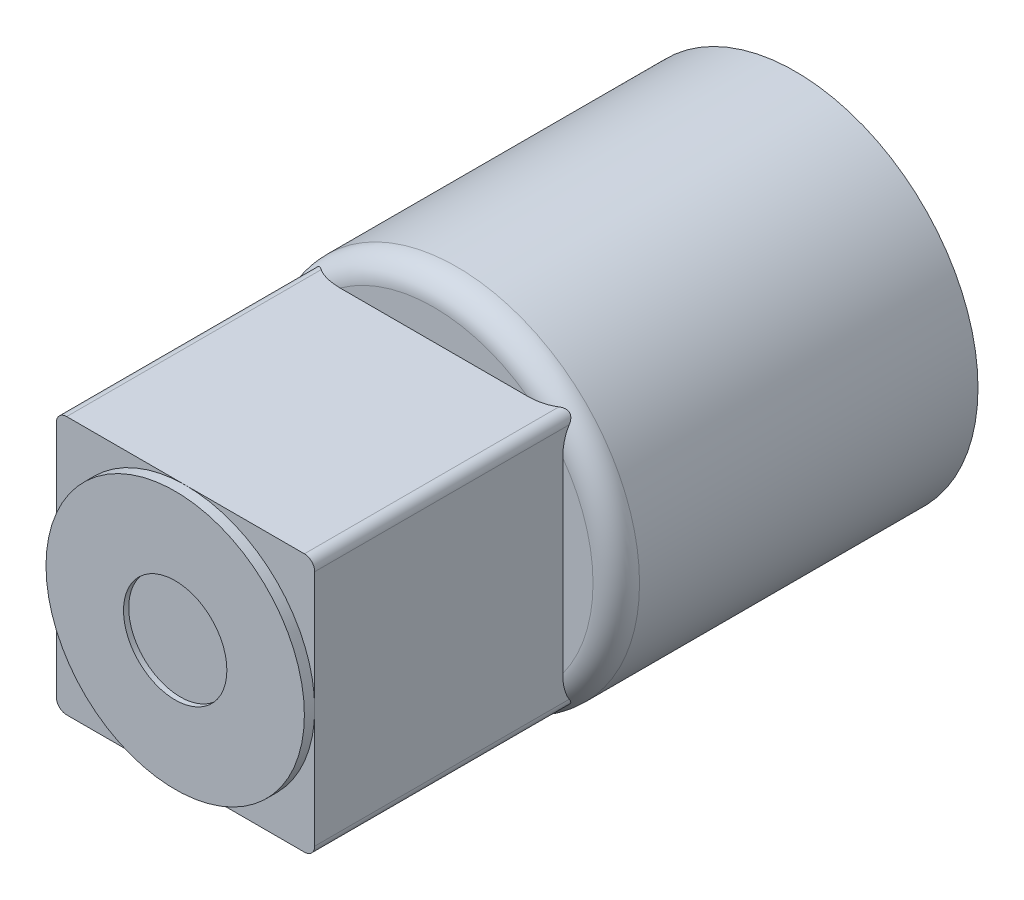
ISO-10303-21;
HEADER;
FILE_DESCRIPTION(('STEP AP214'),'2;1');
FILE_NAME('part.step','',(''),(''),'','','');
FILE_SCHEMA(('AUTOMOTIVE_DESIGN { 1 0 10303 214 1 1 1 1 }'));
ENDSEC;
DATA;
#1=APPLICATION_CONTEXT('core data for automotive mechanical design processes');
#2=APPLICATION_PROTOCOL_DEFINITION('international standard','automotive_design',2000,#1);
#3=PRODUCT_CONTEXT('',#1,'mechanical');
#4=PRODUCT('Part','Part','',(#3));
#5=PRODUCT_RELATED_PRODUCT_CATEGORY('part','',(#4));
#6=PRODUCT_DEFINITION_FORMATION('','',#4);
#7=PRODUCT_DEFINITION_CONTEXT('part definition',#1,'design');
#8=PRODUCT_DEFINITION('design','',#6,#7);
#9=PRODUCT_DEFINITION_SHAPE('','',#8);
#10=(LENGTH_UNIT() NAMED_UNIT(*) SI_UNIT(.MILLI.,.METRE.));
#11=(NAMED_UNIT(*) PLANE_ANGLE_UNIT() SI_UNIT($,.RADIAN.));
#12=(NAMED_UNIT(*) SI_UNIT($,.STERADIAN.) SOLID_ANGLE_UNIT());
#13=UNCERTAINTY_MEASURE_WITH_UNIT(LENGTH_MEASURE(1.E-05),#10,'distance_accuracy_value','');
#14=(GEOMETRIC_REPRESENTATION_CONTEXT(3) GLOBAL_UNCERTAINTY_ASSIGNED_CONTEXT((#13)) GLOBAL_UNIT_ASSIGNED_CONTEXT((#10,
#11,#12)) REPRESENTATION_CONTEXT('',''));
#15=CARTESIAN_POINT('',(0.,0.,0.));
#16=DIRECTION('',(0.,0.,1.));
#17=DIRECTION('',(1.,0.,0.));
#18=AXIS2_PLACEMENT_3D('',#15,#16,#17);
#19=CARTESIAN_POINT('',(0.,0.,12.7));
#20=DIRECTION('',(0.,0.,1.));
#21=DIRECTION('',(1.,0.,0.));
#22=AXIS2_PLACEMENT_3D('',#19,#20,#21);
#23=PLANE('',#22);
#24=CARTESIAN_POINT('',(0.,0.,12.7));
#25=DIRECTION('',(0.,0.,1.));
#26=DIRECTION('',(1.,0.,0.));
#27=AXIS2_PLACEMENT_3D('',#24,#25,#26);
#28=CIRCLE('',#27,2.54);
#29=CARTESIAN_POINT('',(2.54,0.,12.7));
#30=VERTEX_POINT('',#29);
#31=EDGE_CURVE('E535',#30,#30,#28,.T.);
#32=ORIENTED_EDGE('',*,*,#31,.F.);
#33=EDGE_LOOP('',(#32));
#34=FACE_BOUND('',#33,.T.);
#35=CARTESIAN_POINT('',(0.,0.,12.7));
#36=DIRECTION('',(0.,0.,1.));
#37=DIRECTION('',(1.,0.,0.));
#38=AXIS2_PLACEMENT_3D('',#35,#36,#37);
#39=CIRCLE('',#38,6.35);
#40=CARTESIAN_POINT('',(6.35,0.,12.7));
#41=VERTEX_POINT('',#40);
#42=EDGE_CURVE('E405',#41,#41,#39,.T.);
#43=ORIENTED_EDGE('',*,*,#42,.T.);
#44=EDGE_LOOP('',(#43));
#45=FACE_BOUND('',#44,.T.);
#46=ADVANCED_FACE('F84',(#34,#45),#23,.T.);
#47=CARTESIAN_POINT('',(0.,-6.35,12.7));
#48=DIRECTION('',(0.,1.,0.));
#49=DIRECTION('',(0.,0.,1.));
#50=AXIS2_PLACEMENT_3D('',#47,#48,#49);
#51=PLANE('',#50);
#52=DIRECTION('',(1.,0.,0.));
#53=VECTOR('',#52,1.);
#54=CARTESIAN_POINT('',(0.,-6.35,12.192));
#55=LINE('',#54,#53);
#56=CARTESIAN_POINT('',(0.,-6.35,12.192));
#57=VERTEX_POINT('',#56);
#58=CARTESIAN_POINT('',(5.842,-6.35,12.192));
#59=VERTEX_POINT('',#58);
#60=EDGE_CURVE('E206',#57,#59,#55,.T.);
#61=ORIENTED_EDGE('',*,*,#60,.F.);
#62=DIRECTION('',(1.,0.,0.));
#63=VECTOR('',#62,1.);
#64=CARTESIAN_POINT('',(0.,-6.35,12.192));
#65=LINE('',#64,#63);
#66=CARTESIAN_POINT('',(-5.842,-6.35,12.192));
#67=VERTEX_POINT('',#66);
#68=EDGE_CURVE('E220',#67,#57,#65,.T.);
#69=ORIENTED_EDGE('',*,*,#68,.F.);
#70=DIRECTION('',(0.,0.,-1.));
#71=VECTOR('',#70,1.);
#72=CARTESIAN_POINT('',(-5.842,-6.35,-1.143));
#73=LINE('',#72,#71);
#74=CARTESIAN_POINT('',(-5.842,-6.35,-0.318172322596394));
#75=VERTEX_POINT('',#74);
#76=EDGE_CURVE('E355',#67,#75,#73,.T.);
#77=ORIENTED_EDGE('',*,*,#76,.T.);
#78=CARTESIAN_POINT('',(-6.35,-6.35,-1.143));
#79=CARTESIAN_POINT('',(-6.35000403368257,-6.35,-1.11765135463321));
#80=CARTESIAN_POINT('',(-6.34880643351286,-6.35,-1.09231791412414));
#81=CARTESIAN_POINT('',(-6.34405763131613,-6.35,-1.04188941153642));
#82=CARTESIAN_POINT('',(-6.34050802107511,-6.35,-1.01679419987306));
#83=CARTESIAN_POINT('',(-6.32648475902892,-6.35,-0.942558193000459));
#84=CARTESIAN_POINT('',(-6.31263470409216,-6.35,-0.894020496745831));
#85=CARTESIAN_POINT('',(-6.27691926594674,-6.35,-0.800195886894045));
#86=CARTESIAN_POINT('',(-6.25507265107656,-6.35,-0.754901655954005));
#87=CARTESIAN_POINT('',(-6.20460739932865,-6.35,-0.668186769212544));
#88=CARTESIAN_POINT('',(-6.17597494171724,-6.35,-0.62677426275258));
#89=CARTESIAN_POINT('',(-6.10145182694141,-6.35,-0.533574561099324));
#90=CARTESIAN_POINT('',(-6.0531201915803,-6.35,-0.483742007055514));
#91=CARTESIAN_POINT('',(-5.94911311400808,-6.35,-0.392528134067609));
#92=CARTESIAN_POINT('',(-5.89342757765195,-6.35,-0.351158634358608));
#93=CARTESIAN_POINT('',(-5.75177486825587,-6.35,-0.260229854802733));
#94=CARTESIAN_POINT('',(-5.66312778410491,-6.35,-0.214867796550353));
#95=CARTESIAN_POINT('',(-5.47965992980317,-6.35,-0.138405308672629));
#96=CARTESIAN_POINT('',(-5.38481413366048,-6.35,-0.10736736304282));
#97=CARTESIAN_POINT('',(-5.23143400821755,-6.35,-0.0678926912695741));
#98=CARTESIAN_POINT('',(-5.17388950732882,-6.35,-0.0554024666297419));
#99=CARTESIAN_POINT('',(-5.05804890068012,-6.35,-0.0344060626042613));
#100=CARTESIAN_POINT('',(-4.99975247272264,-6.35,-0.0259016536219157));
#101=CARTESIAN_POINT('',(-4.8835088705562,-6.35,-0.0126387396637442));
#102=CARTESIAN_POINT('',(-4.82556688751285,-6.35,-0.00783334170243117));
#103=CARTESIAN_POINT('',(-4.70957225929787,-6.35,-0.00151923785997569));
#104=CARTESIAN_POINT('',(-4.6515198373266,-6.35,-6.49177456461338E-06));
#105=CARTESIAN_POINT('',(-4.59348272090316,-6.35,0.));
#106=B_SPLINE_CURVE_WITH_KNOTS('',3,(#78,#79,#80,#81,#82,#83,#84,#85,#86,#87,#88,#89,#90,#91,
#92,#93,#94,#95,#96,#97,#98,#99,#100,#101,#102,#103,#104,#105),.UNSPECIFIED.,.F.,.F.,(4,2,2,2,2,
2,2,2,2,2,2,2,2,4),(0.,0.0759887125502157,0.151926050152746,0.302481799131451,0.452686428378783,
0.603199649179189,0.810311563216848,1.01771077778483,1.31481675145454,1.61320677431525,
1.7897339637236,1.96633948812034,2.14066750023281,2.31478148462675),.UNSPECIFIED.);
#107=CARTESIAN_POINT('',(-4.59348272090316,-6.35,0.));
#108=VERTEX_POINT('',#107);
#109=EDGE_CURVE('E381',#75,#108,#106,.T.);
#110=ORIENTED_EDGE('',*,*,#109,.T.);
#111=DIRECTION('',(1.,0.,0.));
#112=VECTOR('',#111,1.);
#113=CARTESIAN_POINT('',(0.,-6.35,0.));
#114=LINE('',#113,#112);
#115=CARTESIAN_POINT('',(4.59348272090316,-6.35,0.));
#116=VERTEX_POINT('',#115);
#117=EDGE_CURVE('E237',#108,#116,#114,.T.);
#118=ORIENTED_EDGE('',*,*,#117,.T.);
#119=CARTESIAN_POINT('',(4.59348272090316,-6.35,0.));
#120=CARTESIAN_POINT('',(4.67397091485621,-6.35,-2.43250025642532E-05));
#121=CARTESIAN_POINT('',(4.75452886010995,-6.35,-0.0029243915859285));
#122=CARTESIAN_POINT('',(4.91553563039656,-6.35,-0.0152832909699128));
#123=CARTESIAN_POINT('',(4.9959818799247,-6.35,-0.0247749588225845));
#124=CARTESIAN_POINT('',(5.15694011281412,-6.35,-0.0513453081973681));
#125=CARTESIAN_POINT('',(5.23743358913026,-6.35,-0.0685399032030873));
#126=CARTESIAN_POINT('',(5.39595174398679,-6.35,-0.11151736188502));
#127=CARTESIAN_POINT('',(5.47398169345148,-6.35,-0.137280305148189));
#128=CARTESIAN_POINT('',(5.62003039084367,-6.35,-0.196062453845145));
#129=CARTESIAN_POINT('',(5.68834863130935,-6.35,-0.228327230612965));
#130=CARTESIAN_POINT('',(5.81971354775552,-6.35,-0.301892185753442));
#131=CARTESIAN_POINT('',(5.88277939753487,-6.35,-0.343157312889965));
#132=CARTESIAN_POINT('',(5.99208115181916,-6.35,-0.428308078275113));
#133=CARTESIAN_POINT('',(6.03940787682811,-6.35,-0.470781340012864));
#134=CARTESIAN_POINT('',(6.12658855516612,-6.35,-0.562898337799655));
#135=CARTESIAN_POINT('',(6.16644789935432,-6.35,-0.612536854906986));
#136=CARTESIAN_POINT('',(6.22890336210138,-6.35,-0.707428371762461));
#137=CARTESIAN_POINT('',(6.25336557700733,-6.35,-0.751450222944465));
#138=CARTESIAN_POINT('',(6.29465578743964,-6.35,-0.842905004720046));
#139=CARTESIAN_POINT('',(6.3114991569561,-6.35,-0.890330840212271));
#140=CARTESIAN_POINT('',(6.33254351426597,-6.35,-0.972133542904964));
#141=CARTESIAN_POINT('',(6.33905399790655,-6.35,-1.00592791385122));
#142=CARTESIAN_POINT('',(6.34779790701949,-6.35,-1.07413758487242));
#143=CARTESIAN_POINT('',(6.35002201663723,-6.35,-1.10855407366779));
#144=CARTESIAN_POINT('',(6.35,-6.35,-1.143));
#145=B_SPLINE_CURVE_WITH_KNOTS('',3,(#119,#120,#121,#122,#123,#124,#125,#126,#127,#128,#129,
#130,#131,#132,#133,#134,#135,#136,#137,#138,#139,#140,#141,#142,#143,#144),.UNSPECIFIED.,.F.,
.F.,(4,2,2,2,2,2,2,2,2,2,2,2,4),(0.,0.241519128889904,0.484250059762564,0.730763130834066,
0.976707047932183,1.20278029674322,1.42798835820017,1.61807342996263,1.80802074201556,
1.95850839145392,2.10869100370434,2.21168152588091,2.31489563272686),.UNSPECIFIED.);
#146=CARTESIAN_POINT('',(5.84200000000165,-6.35,-0.318172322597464));
#147=VERTEX_POINT('',#146);
#148=EDGE_CURVE('E315',#116,#147,#145,.T.);
#149=ORIENTED_EDGE('',*,*,#148,.T.);
#150=DIRECTION('',(0.,0.,-1.));
#151=VECTOR('',#150,1.);
#152=CARTESIAN_POINT('',(5.842,-6.35,12.7));
#153=LINE('',#152,#151);
#154=EDGE_CURVE('E223',#147,#59,#153,.F.);
#155=ORIENTED_EDGE('',*,*,#154,.T.);
#156=EDGE_LOOP('',(#61,#69,#77,#110,#118,#149,#155));
#157=FACE_BOUND('',#156,.T.);
#158=ADVANCED_FACE('F218',(#157),#51,.F.);
#159=CARTESIAN_POINT('',(6.35,0.,12.7));
#160=DIRECTION('',(-1.,0.,0.));
#161=DIRECTION('',(0.,0.,1.));
#162=AXIS2_PLACEMENT_3D('',#159,#160,#161);
#163=PLANE('',#162);
#164=DIRECTION('',(0.,1.,0.));
#165=VECTOR('',#164,1.);
#166=CARTESIAN_POINT('',(6.35,0.,12.192));
#167=LINE('',#166,#165);
#168=CARTESIAN_POINT('',(6.35,-5.842,12.192));
#169=VERTEX_POINT('',#168);
#170=CARTESIAN_POINT('',(6.35,0.,12.192));
#171=VERTEX_POINT('',#170);
#172=EDGE_CURVE('E209',#169,#171,#167,.T.);
#173=ORIENTED_EDGE('',*,*,#172,.F.);
#174=DIRECTION('',(0.,0.,-1.));
#175=VECTOR('',#174,1.);
#176=CARTESIAN_POINT('',(6.35,-5.842,12.7));
#177=LINE('',#176,#175);
#178=CARTESIAN_POINT('',(6.35,-5.842,-0.318172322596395));
#179=VERTEX_POINT('',#178);
#180=EDGE_CURVE('E360',#169,#179,#177,.T.);
#181=ORIENTED_EDGE('',*,*,#180,.T.);
#182=CARTESIAN_POINT('',(6.35,-6.35,-1.143));
#183=CARTESIAN_POINT('',(6.35,-6.35000403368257,-1.11765135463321));
#184=CARTESIAN_POINT('',(6.35,-6.34880643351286,-1.09231791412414));
#185=CARTESIAN_POINT('',(6.35,-6.34405763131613,-1.04188941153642));
#186=CARTESIAN_POINT('',(6.35,-6.34050802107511,-1.01679419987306));
#187=CARTESIAN_POINT('',(6.35,-6.32648475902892,-0.942558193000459));
#188=CARTESIAN_POINT('',(6.35,-6.31263470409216,-0.894020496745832));
#189=CARTESIAN_POINT('',(6.35,-6.27691926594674,-0.800195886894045));
#190=CARTESIAN_POINT('',(6.35,-6.25507265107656,-0.754901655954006));
#191=CARTESIAN_POINT('',(6.35,-6.20460739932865,-0.668186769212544));
#192=CARTESIAN_POINT('',(6.35,-6.17597494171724,-0.626774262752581));
#193=CARTESIAN_POINT('',(6.35,-6.10145182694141,-0.533574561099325));
#194=CARTESIAN_POINT('',(6.35,-6.0531201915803,-0.483742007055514));
#195=CARTESIAN_POINT('',(6.35,-5.94911311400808,-0.392528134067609));
#196=CARTESIAN_POINT('',(6.35,-5.89342757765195,-0.351158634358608));
#197=CARTESIAN_POINT('',(6.35,-5.75177486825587,-0.260229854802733));
#198=CARTESIAN_POINT('',(6.35,-5.66312778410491,-0.214867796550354));
#199=CARTESIAN_POINT('',(6.35,-5.47965992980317,-0.13840530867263));
#200=CARTESIAN_POINT('',(6.35,-5.38481413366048,-0.10736736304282));
#201=CARTESIAN_POINT('',(6.35,-5.23143400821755,-0.0678926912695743));
#202=CARTESIAN_POINT('',(6.35,-5.17388950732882,-0.0554024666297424));
#203=CARTESIAN_POINT('',(6.35,-5.05804890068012,-0.0344060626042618));
#204=CARTESIAN_POINT('',(6.35,-4.99975247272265,-0.0259016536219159));
#205=CARTESIAN_POINT('',(6.35,-4.8835088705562,-0.0126387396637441));
#206=CARTESIAN_POINT('',(6.35,-4.82556688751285,-0.00783334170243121));
#207=CARTESIAN_POINT('',(6.35,-4.70957225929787,-0.00151923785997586));
#208=CARTESIAN_POINT('',(6.35,-4.6515198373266,-6.49177456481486E-06));
#209=CARTESIAN_POINT('',(6.35,-4.59348272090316,0.));
#210=B_SPLINE_CURVE_WITH_KNOTS('',3,(#182,#183,#184,#185,#186,#187,#188,#189,#190,#191,#192,
#193,#194,#195,#196,#197,#198,#199,#200,#201,#202,#203,#204,#205,#206,#207,#208,#209),
.UNSPECIFIED.,.F.,.F.,(4,2,2,2,2,2,2,2,2,2,2,2,2,4),(0.,0.0759887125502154,0.151926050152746,
0.302481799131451,0.452686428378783,0.603199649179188,0.810311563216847,1.01771077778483,
1.31481675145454,1.61320677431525,1.7897339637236,1.96633948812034,2.14066750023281,
2.31478148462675),.UNSPECIFIED.);
#211=CARTESIAN_POINT('',(6.35,-4.59348272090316,0.));
#212=VERTEX_POINT('',#211);
#213=EDGE_CURVE('E310',#179,#212,#210,.T.);
#214=ORIENTED_EDGE('',*,*,#213,.T.);
#215=DIRECTION('',(0.,1.,0.));
#216=VECTOR('',#215,1.);
#217=CARTESIAN_POINT('',(6.35,0.,0.));
#218=LINE('',#217,#216);
#219=CARTESIAN_POINT('',(6.35,4.59348272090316,0.));
#220=VERTEX_POINT('',#219);
#221=EDGE_CURVE('E244',#212,#220,#218,.T.);
#222=ORIENTED_EDGE('',*,*,#221,.T.);
#223=CARTESIAN_POINT('',(6.35,4.59348272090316,0.));
#224=CARTESIAN_POINT('',(6.35,4.67397091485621,-2.43250025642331E-05));
#225=CARTESIAN_POINT('',(6.35,4.75452886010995,-0.00292439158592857));
#226=CARTESIAN_POINT('',(6.35,4.91553563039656,-0.015283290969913));
#227=CARTESIAN_POINT('',(6.35,4.9959818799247,-0.0247749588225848));
#228=CARTESIAN_POINT('',(6.35,5.15694011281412,-0.0513453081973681));
#229=CARTESIAN_POINT('',(6.35,5.23743358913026,-0.0685399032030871));
#230=CARTESIAN_POINT('',(6.35,5.39595174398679,-0.111517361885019));
#231=CARTESIAN_POINT('',(6.35,5.47398169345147,-0.137280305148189));
#232=CARTESIAN_POINT('',(6.35,5.62003039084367,-0.196062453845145));
#233=CARTESIAN_POINT('',(6.35,5.68834863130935,-0.228327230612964));
#234=CARTESIAN_POINT('',(6.35,5.81971354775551,-0.301892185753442));
#235=CARTESIAN_POINT('',(6.35,5.88277939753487,-0.343157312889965));
#236=CARTESIAN_POINT('',(6.35,5.99208115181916,-0.428308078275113));
#237=CARTESIAN_POINT('',(6.35,6.03940787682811,-0.470781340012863));
#238=CARTESIAN_POINT('',(6.35,6.12658855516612,-0.562898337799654));
#239=CARTESIAN_POINT('',(6.35,6.16644789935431,-0.612536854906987));
#240=CARTESIAN_POINT('',(6.35,6.22890336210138,-0.707428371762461));
#241=CARTESIAN_POINT('',(6.35,6.25336557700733,-0.751450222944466));
#242=CARTESIAN_POINT('',(6.35,6.29465578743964,-0.842905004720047));
#243=CARTESIAN_POINT('',(6.35,6.3114991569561,-0.890330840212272));
#244=CARTESIAN_POINT('',(6.35,6.33254351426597,-0.972133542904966));
#245=CARTESIAN_POINT('',(6.35,6.33905399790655,-1.00592791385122));
#246=CARTESIAN_POINT('',(6.35,6.34779790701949,-1.07413758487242));
#247=CARTESIAN_POINT('',(6.35,6.35002201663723,-1.10855407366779));
#248=CARTESIAN_POINT('',(6.35,6.35,-1.143));
#249=B_SPLINE_CURVE_WITH_KNOTS('',3,(#223,#224,#225,#226,#227,#228,#229,#230,#231,#232,#233,
#234,#235,#236,#237,#238,#239,#240,#241,#242,#243,#244,#245,#246,#247,#248),.UNSPECIFIED.,.F.,
.F.,(4,2,2,2,2,2,2,2,2,2,2,2,4),(0.,0.241519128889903,0.484250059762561,0.730763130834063,
0.976707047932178,1.20278029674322,1.42798835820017,1.61807342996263,1.80802074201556,
1.95850839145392,2.10869100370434,2.21168152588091,2.31489563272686),.UNSPECIFIED.);
#250=CARTESIAN_POINT('',(6.35,5.84200000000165,-0.318172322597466));
#251=VERTEX_POINT('',#250);
#252=EDGE_CURVE('E304',#220,#251,#249,.T.);
#253=ORIENTED_EDGE('',*,*,#252,.T.);
#254=DIRECTION('',(0.,0.,-1.));
#255=VECTOR('',#254,1.);
#256=CARTESIAN_POINT('',(6.35,5.842,12.7));
#257=LINE('',#256,#255);
#258=CARTESIAN_POINT('',(6.35,5.842,12.192));
#259=VERTEX_POINT('',#258);
#260=EDGE_CURVE('E357',#251,#259,#257,.F.);
#261=ORIENTED_EDGE('',*,*,#260,.T.);
#262=DIRECTION('',(0.,1.,0.));
#263=VECTOR('',#262,1.);
#264=CARTESIAN_POINT('',(6.35,0.,12.192));
#265=LINE('',#264,#263);
#266=EDGE_CURVE('E104',#171,#259,#265,.T.);
#267=ORIENTED_EDGE('',*,*,#266,.F.);
#268=EDGE_LOOP('',(#173,#181,#214,#222,#253,#261,#267));
#269=FACE_BOUND('',#268,.T.);
#270=ADVANCED_FACE('F296',(#269),#163,.F.);
#271=CARTESIAN_POINT('',(5.842,-5.842,12.7));
#272=DIRECTION('',(0.,0.,-1.));
#273=DIRECTION('',(-1.,0.,0.));
#274=AXIS2_PLACEMENT_3D('',#271,#272,#273);
#275=CYLINDRICAL_SURFACE('',#274,0.508);
#276=ORIENTED_EDGE('',*,*,#180,.F.);
#277=CARTESIAN_POINT('',(5.842,-5.842,12.192));
#278=DIRECTION('',(0.,0.,1.));
#279=DIRECTION('',(1.,0.,0.));
#280=AXIS2_PLACEMENT_3D('',#277,#278,#279);
#281=CIRCLE('',#280,0.508);
#282=EDGE_CURVE('E224',#59,#169,#281,.T.);
#283=ORIENTED_EDGE('',*,*,#282,.F.);
#284=ORIENTED_EDGE('',*,*,#154,.F.);
#285=CARTESIAN_POINT('',(6.35,-5.842,-0.318172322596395));
#286=CARTESIAN_POINT('',(6.34999615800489,-5.85588789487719,-0.327189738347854));
#287=CARTESIAN_POINT('',(6.34943055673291,-5.86979961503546,-0.336153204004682));
#288=CARTESIAN_POINT('',(6.3471325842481,-5.89769823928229,-0.353871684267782));
#289=CARTESIAN_POINT('',(6.34539785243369,-5.911685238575,-0.362626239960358));
#290=CARTESIAN_POINT('',(6.33831445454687,-5.95409726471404,-0.388603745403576));
#291=CARTESIAN_POINT('',(6.33108393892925,-5.98259452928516,-0.405287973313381));
#292=CARTESIAN_POINT('',(6.31457000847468,-6.02941311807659,-0.430155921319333));
#293=CARTESIAN_POINT('',(6.30688921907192,-6.04780734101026,-0.439271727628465));
#294=CARTESIAN_POINT('',(6.2889954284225,-6.0842132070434,-0.455396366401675));
#295=CARTESIAN_POINT('',(6.27879483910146,-6.10222626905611,-0.462415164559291));
#296=CARTESIAN_POINT('',(6.25779255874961,-6.13437173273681,-0.4725691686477));
#297=CARTESIAN_POINT('',(6.24741270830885,-6.14862911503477,-0.476170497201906));
#298=CARTESIAN_POINT('',(6.22498718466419,-6.17621533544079,-0.480983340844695));
#299=CARTESIAN_POINT('',(6.21294248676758,-6.18954471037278,-0.482196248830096));
#300=CARTESIAN_POINT('',(6.18749171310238,-6.2148565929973,-0.482065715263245));
#301=CARTESIAN_POINT('',(6.17408376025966,-6.22683719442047,-0.480718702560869));
#302=CARTESIAN_POINT('',(6.14636062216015,-6.24911895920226,-0.475648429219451));
#303=CARTESIAN_POINT('',(6.13204482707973,-6.25941897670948,-0.471923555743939));
#304=CARTESIAN_POINT('',(6.09834853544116,-6.28116713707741,-0.461054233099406));
#305=CARTESIAN_POINT('',(6.07878269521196,-6.29196909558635,-0.453205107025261));
#306=CARTESIAN_POINT('',(6.03925026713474,-6.31065564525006,-0.43517232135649));
#307=CARTESIAN_POINT('',(6.01928207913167,-6.31852406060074,-0.424976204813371));
#308=CARTESIAN_POINT('',(5.97283891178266,-6.3336519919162,-0.399636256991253));
#309=CARTESIAN_POINT('',(5.94633644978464,-6.33990200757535,-0.383955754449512));
#310=CARTESIAN_POINT('',(5.89383782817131,-6.34802335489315,-0.351570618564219));
#311=CARTESIAN_POINT('',(5.86784014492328,-6.34996047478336,-0.334885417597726));
#312=CARTESIAN_POINT('',(5.84200000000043,-6.35,-0.318172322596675));
#313=B_SPLINE_CURVE_WITH_KNOTS('',3,(#285,#286,#287,#288,#289,#290,#291,#292,#293,#294,#295,
#296,#297,#298,#299,#300,#301,#302,#303,#304,#305,#306,#307,#308,#309,#310,#311,#312),
.UNSPECIFIED.,.F.,.F.,(4,2,2,2,2,2,2,2,2,2,2,2,2,4),(0.,0.0496452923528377,0.0993911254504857,
0.200236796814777,0.265809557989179,0.33106554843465,0.384835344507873,0.438573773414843,
0.492387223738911,0.546237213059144,0.616906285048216,0.687959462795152,0.781861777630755,
0.874321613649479),.UNSPECIFIED.);
#314=EDGE_CURVE('E97',#179,#147,#313,.T.);
#315=ORIENTED_EDGE('',*,*,#314,.F.);
#316=EDGE_LOOP('',(#276,#283,#284,#315));
#317=FACE_BOUND('',#316,.T.);
#318=ADVANCED_FACE('F300',(#317),#275,.T.);
#319=CARTESIAN_POINT('',(-6.35,0.,12.7));
#320=DIRECTION('',(-1.,0.,0.));
#321=DIRECTION('',(0.,0.,1.));
#322=AXIS2_PLACEMENT_3D('',#319,#320,#321);
#323=PLANE('',#322);
#324=DIRECTION('',(0.,-1.,0.));
#325=VECTOR('',#324,1.);
#326=CARTESIAN_POINT('',(-6.35,0.,12.192));
#327=LINE('',#326,#325);
#328=CARTESIAN_POINT('',(-6.35,0.,12.192));
#329=VERTEX_POINT('',#328);
#330=CARTESIAN_POINT('',(-6.35,-5.842,12.192));
#331=VERTEX_POINT('',#330);
#332=EDGE_CURVE('E112',#329,#331,#327,.T.);
#333=ORIENTED_EDGE('',*,*,#332,.F.);
#334=DIRECTION('',(0.,-1.,0.));
#335=VECTOR('',#334,1.);
#336=CARTESIAN_POINT('',(-6.35,0.,12.192));
#337=LINE('',#336,#335);
#338=CARTESIAN_POINT('',(-6.35,5.842,12.192));
#339=VERTEX_POINT('',#338);
#340=EDGE_CURVE('E403',#339,#329,#337,.T.);
#341=ORIENTED_EDGE('',*,*,#340,.F.);
#342=DIRECTION('',(0.,0.,-1.));
#343=VECTOR('',#342,1.);
#344=CARTESIAN_POINT('',(-6.35,5.842,12.7));
#345=LINE('',#344,#343);
#346=CARTESIAN_POINT('',(-6.35,5.842,-0.318172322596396));
#347=VERTEX_POINT('',#346);
#348=EDGE_CURVE('E367',#339,#347,#345,.T.);
#349=ORIENTED_EDGE('',*,*,#348,.T.);
#350=CARTESIAN_POINT('',(-6.35,6.35,-1.143));
#351=CARTESIAN_POINT('',(-6.35,6.35000403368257,-1.11765135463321));
#352=CARTESIAN_POINT('',(-6.35,6.34880643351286,-1.09231791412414));
#353=CARTESIAN_POINT('',(-6.35,6.34405763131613,-1.04188941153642));
#354=CARTESIAN_POINT('',(-6.35,6.34050802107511,-1.01679419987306));
#355=CARTESIAN_POINT('',(-6.35,6.32648475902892,-0.942558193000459));
#356=CARTESIAN_POINT('',(-6.35,6.31263470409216,-0.894020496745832));
#357=CARTESIAN_POINT('',(-6.35,6.27691926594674,-0.800195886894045));
#358=CARTESIAN_POINT('',(-6.35,6.25507265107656,-0.754901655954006));
#359=CARTESIAN_POINT('',(-6.35,6.20460739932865,-0.668186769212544));
#360=CARTESIAN_POINT('',(-6.35,6.17597494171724,-0.626774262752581));
#361=CARTESIAN_POINT('',(-6.35,6.10145182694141,-0.533574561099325));
#362=CARTESIAN_POINT('',(-6.35,6.0531201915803,-0.483742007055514));
#363=CARTESIAN_POINT('',(-6.35,5.94911311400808,-0.392528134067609));
#364=CARTESIAN_POINT('',(-6.35,5.89342757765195,-0.351158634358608));
#365=CARTESIAN_POINT('',(-6.35,5.75177486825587,-0.260229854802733));
#366=CARTESIAN_POINT('',(-6.35,5.66312778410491,-0.214867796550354));
#367=CARTESIAN_POINT('',(-6.35,5.47965992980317,-0.138405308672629));
#368=CARTESIAN_POINT('',(-6.35,5.38481413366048,-0.10736736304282));
#369=CARTESIAN_POINT('',(-6.35,5.23143400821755,-0.0678926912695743));
#370=CARTESIAN_POINT('',(-6.35,5.17388950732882,-0.0554024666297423));
#371=CARTESIAN_POINT('',(-6.35,5.05804890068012,-0.0344060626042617));
#372=CARTESIAN_POINT('',(-6.35,4.99975247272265,-0.0259016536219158));
#373=CARTESIAN_POINT('',(-6.35,4.8835088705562,-0.0126387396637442));
#374=CARTESIAN_POINT('',(-6.35,4.82556688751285,-0.00783334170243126));
#375=CARTESIAN_POINT('',(-6.35,4.70957225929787,-0.00151923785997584));
#376=CARTESIAN_POINT('',(-6.35,4.6515198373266,-6.49177456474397E-06));
#377=CARTESIAN_POINT('',(-6.35,4.59348272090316,0.));
#378=B_SPLINE_CURVE_WITH_KNOTS('',3,(#350,#351,#352,#353,#354,#355,#356,#357,#358,#359,#360,
#361,#362,#363,#364,#365,#366,#367,#368,#369,#370,#371,#372,#373,#374,#375,#376,#377),
.UNSPECIFIED.,.F.,.F.,(4,2,2,2,2,2,2,2,2,2,2,2,2,4),(0.,0.0759887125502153,0.151926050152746,
0.302481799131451,0.452686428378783,0.603199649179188,0.810311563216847,1.01771077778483,
1.31481675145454,1.61320677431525,1.7897339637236,1.96633948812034,2.14066750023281,
2.31478148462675),.UNSPECIFIED.);
#379=CARTESIAN_POINT('',(-6.35,4.59348272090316,0.));
#380=VERTEX_POINT('',#379);
#381=EDGE_CURVE('E372',#347,#380,#378,.T.);
#382=ORIENTED_EDGE('',*,*,#381,.T.);
#383=DIRECTION('',(0.,1.,0.));
#384=VECTOR('',#383,1.);
#385=CARTESIAN_POINT('',(-6.35,0.,0.));
#386=LINE('',#385,#384);
#387=CARTESIAN_POINT('',(-6.35,-4.59348272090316,0.));
#388=VERTEX_POINT('',#387);
#389=EDGE_CURVE('E250',#388,#380,#386,.T.);
#390=ORIENTED_EDGE('',*,*,#389,.F.);
#391=CARTESIAN_POINT('',(-6.35,-4.59348272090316,0.));
#392=CARTESIAN_POINT('',(-6.35,-4.67397091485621,-2.43250025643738E-05));
#393=CARTESIAN_POINT('',(-6.35,-4.75452886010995,-0.00292439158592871));
#394=CARTESIAN_POINT('',(-6.35,-4.91553563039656,-0.0152832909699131));
#395=CARTESIAN_POINT('',(-6.35,-4.9959818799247,-0.0247749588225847));
#396=CARTESIAN_POINT('',(-6.35,-5.15694011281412,-0.051345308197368));
#397=CARTESIAN_POINT('',(-6.35,-5.23743358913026,-0.0685399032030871));
#398=CARTESIAN_POINT('',(-6.35,-5.39595174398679,-0.11151736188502));
#399=CARTESIAN_POINT('',(-6.35,-5.47398169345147,-0.137280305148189));
#400=CARTESIAN_POINT('',(-6.35,-5.62003039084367,-0.196062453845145));
#401=CARTESIAN_POINT('',(-6.35,-5.68834863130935,-0.228327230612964));
#402=CARTESIAN_POINT('',(-6.35,-5.81971354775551,-0.301892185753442));
#403=CARTESIAN_POINT('',(-6.35,-5.88277939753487,-0.343157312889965));
#404=CARTESIAN_POINT('',(-6.35,-5.99208115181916,-0.428308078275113));
#405=CARTESIAN_POINT('',(-6.35,-6.03940787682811,-0.470781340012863));
#406=CARTESIAN_POINT('',(-6.35,-6.12658855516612,-0.562898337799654));
#407=CARTESIAN_POINT('',(-6.35,-6.16644789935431,-0.612536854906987));
#408=CARTESIAN_POINT('',(-6.35,-6.22890336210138,-0.707428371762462));
#409=CARTESIAN_POINT('',(-6.35,-6.25336557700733,-0.751450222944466));
#410=CARTESIAN_POINT('',(-6.35,-6.29465578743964,-0.842905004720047));
#411=CARTESIAN_POINT('',(-6.35,-6.3114991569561,-0.890330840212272));
#412=CARTESIAN_POINT('',(-6.35,-6.33254351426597,-0.972133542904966));
#413=CARTESIAN_POINT('',(-6.35,-6.33905399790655,-1.00592791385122));
#414=CARTESIAN_POINT('',(-6.35,-6.34779790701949,-1.07413758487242));
#415=CARTESIAN_POINT('',(-6.35,-6.35002201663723,-1.10855407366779));
#416=CARTESIAN_POINT('',(-6.35,-6.35,-1.143));
#417=B_SPLINE_CURVE_WITH_KNOTS('',3,(#391,#392,#393,#394,#395,#396,#397,#398,#399,#400,#401,
#402,#403,#404,#405,#406,#407,#408,#409,#410,#411,#412,#413,#414,#415,#416),.UNSPECIFIED.,.F.,
.F.,(4,2,2,2,2,2,2,2,2,2,2,2,4),(0.,0.241519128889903,0.484250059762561,0.730763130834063,
0.976707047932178,1.20278029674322,1.42798835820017,1.61807342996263,1.80802074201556,
1.95850839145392,2.10869100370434,2.21168152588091,2.31489563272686),.UNSPECIFIED.);
#418=CARTESIAN_POINT('',(-6.35,-5.84200000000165,-0.318172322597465));
#419=VERTEX_POINT('',#418);
#420=EDGE_CURVE('E377',#388,#419,#417,.T.);
#421=ORIENTED_EDGE('',*,*,#420,.T.);
#422=DIRECTION('',(0.,0.,-1.));
#423=VECTOR('',#422,1.);
#424=CARTESIAN_POINT('',(-6.35,-5.842,12.7));
#425=LINE('',#424,#423);
#426=EDGE_CURVE('E369',#419,#331,#425,.F.);
#427=ORIENTED_EDGE('',*,*,#426,.T.);
#428=EDGE_LOOP('',(#333,#341,#349,#382,#390,#421,#427));
#429=FACE_BOUND('',#428,.T.);
#430=ADVANCED_FACE('F292',(#429),#323,.T.);
#431=CARTESIAN_POINT('',(0.,6.35,12.7));
#432=DIRECTION('',(0.,1.,0.));
#433=DIRECTION('',(0.,0.,1.));
#434=AXIS2_PLACEMENT_3D('',#431,#432,#433);
#435=PLANE('',#434);
#436=DIRECTION('',(0.,0.,-1.));
#437=VECTOR('',#436,1.);
#438=CARTESIAN_POINT('',(-5.842,6.35,12.7));
#439=LINE('',#438,#437);
#440=CARTESIAN_POINT('',(-5.84200000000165,6.35,-0.318172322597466));
#441=VERTEX_POINT('',#440);
#442=CARTESIAN_POINT('',(-5.842,6.35,12.192));
#443=VERTEX_POINT('',#442);
#444=EDGE_CURVE('E362',#441,#443,#439,.F.);
#445=ORIENTED_EDGE('',*,*,#444,.T.);
#446=DIRECTION('',(-1.,0.,0.));
#447=VECTOR('',#446,1.);
#448=CARTESIAN_POINT('',(0.,6.35,12.192));
#449=LINE('',#448,#447);
#450=CARTESIAN_POINT('',(0.,6.35,12.192));
#451=VERTEX_POINT('',#450);
#452=EDGE_CURVE('E399',#451,#443,#449,.T.);
#453=ORIENTED_EDGE('',*,*,#452,.F.);
#454=DIRECTION('',(-1.,0.,0.));
#455=VECTOR('',#454,1.);
#456=CARTESIAN_POINT('',(0.,6.35,12.192));
#457=LINE('',#456,#455);
#458=CARTESIAN_POINT('',(5.842,6.35,12.192));
#459=VERTEX_POINT('',#458);
#460=EDGE_CURVE('E230',#459,#451,#457,.T.);
#461=ORIENTED_EDGE('',*,*,#460,.F.);
#462=DIRECTION('',(0.,0.,-1.));
#463=VECTOR('',#462,1.);
#464=CARTESIAN_POINT('',(5.842,6.35,-1.143));
#465=LINE('',#464,#463);
#466=CARTESIAN_POINT('',(5.842,6.35,-0.318172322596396));
#467=VERTEX_POINT('',#466);
#468=EDGE_CURVE('E365',#459,#467,#465,.T.);
#469=ORIENTED_EDGE('',*,*,#468,.T.);
#470=CARTESIAN_POINT('',(6.35,6.35,-1.143));
#471=CARTESIAN_POINT('',(6.35000403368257,6.35,-1.11765135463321));
#472=CARTESIAN_POINT('',(6.34880643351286,6.35,-1.09231791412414));
#473=CARTESIAN_POINT('',(6.34405763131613,6.35,-1.04188941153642));
#474=CARTESIAN_POINT('',(6.34050802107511,6.35,-1.01679419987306));
#475=CARTESIAN_POINT('',(6.32648475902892,6.35,-0.942558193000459));
#476=CARTESIAN_POINT('',(6.31263470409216,6.35,-0.894020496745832));
#477=CARTESIAN_POINT('',(6.27691926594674,6.35,-0.800195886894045));
#478=CARTESIAN_POINT('',(6.25507265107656,6.35,-0.754901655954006));
#479=CARTESIAN_POINT('',(6.20460739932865,6.35,-0.668186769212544));
#480=CARTESIAN_POINT('',(6.17597494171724,6.35,-0.626774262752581));
#481=CARTESIAN_POINT('',(6.10145182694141,6.35,-0.533574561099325));
#482=CARTESIAN_POINT('',(6.05312019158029,6.35,-0.483742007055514));
#483=CARTESIAN_POINT('',(5.94911311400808,6.35,-0.392528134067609));
#484=CARTESIAN_POINT('',(5.89342757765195,6.35,-0.351158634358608));
#485=CARTESIAN_POINT('',(5.75177486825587,6.35,-0.260229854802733));
#486=CARTESIAN_POINT('',(5.66312778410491,6.35,-0.214867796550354));
#487=CARTESIAN_POINT('',(5.47965992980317,6.35,-0.138405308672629));
#488=CARTESIAN_POINT('',(5.38481413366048,6.35,-0.10736736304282));
#489=CARTESIAN_POINT('',(5.23143400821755,6.35,-0.0678926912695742));
#490=CARTESIAN_POINT('',(5.17388950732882,6.35,-0.0554024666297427));
#491=CARTESIAN_POINT('',(5.05804890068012,6.35,-0.0344060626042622));
#492=CARTESIAN_POINT('',(4.99975247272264,6.35,-0.025901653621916));
#493=CARTESIAN_POINT('',(4.8835088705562,6.35,-0.012638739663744));
#494=CARTESIAN_POINT('',(4.82556688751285,6.35,-0.00783334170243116));
#495=CARTESIAN_POINT('',(4.70957225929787,6.35,-0.00151923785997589));
#496=CARTESIAN_POINT('',(4.6515198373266,6.35,-6.49177456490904E-06));
#497=CARTESIAN_POINT('',(4.59348272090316,6.35,0.));
#498=B_SPLINE_CURVE_WITH_KNOTS('',3,(#470,#471,#472,#473,#474,#475,#476,#477,#478,#479,#480,
#481,#482,#483,#484,#485,#486,#487,#488,#489,#490,#491,#492,#493,#494,#495,#496,#497),
.UNSPECIFIED.,.F.,.F.,(4,2,2,2,2,2,2,2,2,2,2,2,2,4),(0.,0.0759887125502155,0.151926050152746,
0.302481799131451,0.452686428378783,0.603199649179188,0.810311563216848,1.01771077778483,
1.31481675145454,1.61320677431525,1.7897339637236,1.96633948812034,2.14066750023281,
2.31478148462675),.UNSPECIFIED.);
#499=CARTESIAN_POINT('',(4.59348272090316,6.35,0.));
#500=VERTEX_POINT('',#499);
#501=EDGE_CURVE('E278',#467,#500,#498,.T.);
#502=ORIENTED_EDGE('',*,*,#501,.T.);
#503=DIRECTION('',(1.,0.,0.));
#504=VECTOR('',#503,1.);
#505=CARTESIAN_POINT('',(0.,6.35,0.));
#506=LINE('',#505,#504);
#507=CARTESIAN_POINT('',(-4.59348272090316,6.35,0.));
#508=VERTEX_POINT('',#507);
#509=EDGE_CURVE('E247',#508,#500,#506,.T.);
#510=ORIENTED_EDGE('',*,*,#509,.F.);
#511=CARTESIAN_POINT('',(-4.59348272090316,6.35,0.));
#512=CARTESIAN_POINT('',(-4.67397091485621,6.35,-2.43250025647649E-05));
#513=CARTESIAN_POINT('',(-4.75452886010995,6.35,-0.00292439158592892));
#514=CARTESIAN_POINT('',(-4.91553563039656,6.35,-0.0152832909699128));
#515=CARTESIAN_POINT('',(-4.9959818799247,6.35,-0.0247749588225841));
#516=CARTESIAN_POINT('',(-5.15694011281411,6.35,-0.0513453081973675));
#517=CARTESIAN_POINT('',(-5.23743358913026,6.35,-0.0685399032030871));
#518=CARTESIAN_POINT('',(-5.39595174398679,6.35,-0.11151736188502));
#519=CARTESIAN_POINT('',(-5.47398169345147,6.35,-0.137280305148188));
#520=CARTESIAN_POINT('',(-5.62003039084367,6.35,-0.196062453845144));
#521=CARTESIAN_POINT('',(-5.68834863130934,6.35,-0.228327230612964));
#522=CARTESIAN_POINT('',(-5.81971354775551,6.35,-0.301892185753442));
#523=CARTESIAN_POINT('',(-5.88277939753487,6.35,-0.343157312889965));
#524=CARTESIAN_POINT('',(-5.99208115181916,6.35,-0.428308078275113));
#525=CARTESIAN_POINT('',(-6.03940787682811,6.35,-0.470781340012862));
#526=CARTESIAN_POINT('',(-6.12658855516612,6.35,-0.562898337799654));
#527=CARTESIAN_POINT('',(-6.16644789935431,6.35,-0.612536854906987));
#528=CARTESIAN_POINT('',(-6.22890336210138,6.35,-0.707428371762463));
#529=CARTESIAN_POINT('',(-6.25336557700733,6.35,-0.751450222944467));
#530=CARTESIAN_POINT('',(-6.29465578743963,6.35,-0.842905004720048));
#531=CARTESIAN_POINT('',(-6.3114991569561,6.35,-0.890330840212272));
#532=CARTESIAN_POINT('',(-6.33254351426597,6.35,-0.972133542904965));
#533=CARTESIAN_POINT('',(-6.33905399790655,6.35,-1.00592791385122));
#534=CARTESIAN_POINT('',(-6.34779790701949,6.35,-1.07413758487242));
#535=CARTESIAN_POINT('',(-6.35002201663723,6.35,-1.10855407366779));
#536=CARTESIAN_POINT('',(-6.35,6.35,-1.143));
#537=B_SPLINE_CURVE_WITH_KNOTS('',3,(#511,#512,#513,#514,#515,#516,#517,#518,#519,#520,#521,
#522,#523,#524,#525,#526,#527,#528,#529,#530,#531,#532,#533,#534,#535,#536),.UNSPECIFIED.,.F.,
.F.,(4,2,2,2,2,2,2,2,2,2,2,2,4),(0.,0.241519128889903,0.484250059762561,0.730763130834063,
0.976707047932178,1.20278029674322,1.42798835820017,1.61807342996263,1.80802074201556,
1.95850839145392,2.10869100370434,2.21168152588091,2.31489563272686),.UNSPECIFIED.);
#538=EDGE_CURVE('E271',#508,#441,#537,.T.);
#539=ORIENTED_EDGE('',*,*,#538,.T.);
#540=EDGE_LOOP('',(#445,#453,#461,#469,#502,#510,#539));
#541=FACE_BOUND('',#540,.T.);
#542=ADVANCED_FACE('F286',(#541),#435,.T.);
#543=CARTESIAN_POINT('',(-5.842,5.842,12.7));
#544=DIRECTION('',(0.,0.,-1.));
#545=DIRECTION('',(-1.,0.,0.));
#546=AXIS2_PLACEMENT_3D('',#543,#544,#545);
#547=CYLINDRICAL_SURFACE('',#546,0.508);
#548=ORIENTED_EDGE('',*,*,#348,.F.);
#549=CARTESIAN_POINT('',(-5.842,5.842,12.192));
#550=DIRECTION('',(0.,0.,1.));
#551=DIRECTION('',(1.,0.,0.));
#552=AXIS2_PLACEMENT_3D('',#549,#550,#551);
#553=CIRCLE('',#552,0.508);
#554=EDGE_CURVE('E401',#443,#339,#553,.T.);
#555=ORIENTED_EDGE('',*,*,#554,.F.);
#556=ORIENTED_EDGE('',*,*,#444,.F.);
#557=CARTESIAN_POINT('',(-6.35,5.842,-0.318172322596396));
#558=CARTESIAN_POINT('',(-6.34999615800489,5.85588789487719,-0.327189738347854));
#559=CARTESIAN_POINT('',(-6.34943055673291,5.86979961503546,-0.336153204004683));
#560=CARTESIAN_POINT('',(-6.3471325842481,5.8976982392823,-0.353871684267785));
#561=CARTESIAN_POINT('',(-6.34539785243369,5.911685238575,-0.362626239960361));
#562=CARTESIAN_POINT('',(-6.33831445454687,5.95409726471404,-0.388603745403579));
#563=CARTESIAN_POINT('',(-6.33108393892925,5.98259452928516,-0.405287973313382));
#564=CARTESIAN_POINT('',(-6.31457000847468,6.02941311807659,-0.430155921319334));
#565=CARTESIAN_POINT('',(-6.30688921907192,6.04780734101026,-0.439271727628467));
#566=CARTESIAN_POINT('',(-6.2889954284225,6.0842132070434,-0.455396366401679));
#567=CARTESIAN_POINT('',(-6.27879483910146,6.10222626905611,-0.462415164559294));
#568=CARTESIAN_POINT('',(-6.25779255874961,6.13437173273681,-0.472569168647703));
#569=CARTESIAN_POINT('',(-6.24741270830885,6.14862911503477,-0.476170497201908));
#570=CARTESIAN_POINT('',(-6.22498718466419,6.17621533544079,-0.480983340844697));
#571=CARTESIAN_POINT('',(-6.21294248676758,6.18954471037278,-0.482196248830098));
#572=CARTESIAN_POINT('',(-6.18749171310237,6.21485659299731,-0.482065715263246));
#573=CARTESIAN_POINT('',(-6.17408376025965,6.22683719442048,-0.48071870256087));
#574=CARTESIAN_POINT('',(-6.14636062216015,6.24911895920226,-0.475648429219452));
#575=CARTESIAN_POINT('',(-6.13204482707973,6.25941897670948,-0.471923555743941));
#576=CARTESIAN_POINT('',(-6.09834853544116,6.28116713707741,-0.461054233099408));
#577=CARTESIAN_POINT('',(-6.07878269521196,6.29196909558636,-0.453205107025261));
#578=CARTESIAN_POINT('',(-6.03925026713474,6.31065564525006,-0.435172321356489));
#579=CARTESIAN_POINT('',(-6.01928207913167,6.31852406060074,-0.424976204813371));
#580=CARTESIAN_POINT('',(-5.97283891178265,6.3336519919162,-0.399636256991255));
#581=CARTESIAN_POINT('',(-5.94633644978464,6.33990200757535,-0.383955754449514));
#582=CARTESIAN_POINT('',(-5.89383782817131,6.34802335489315,-0.35157061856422));
#583=CARTESIAN_POINT('',(-5.86784014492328,6.34996047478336,-0.334885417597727));
#584=CARTESIAN_POINT('',(-5.84200000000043,6.35,-0.318172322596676));
#585=B_SPLINE_CURVE_WITH_KNOTS('',3,(#557,#558,#559,#560,#561,#562,#563,#564,#565,#566,#567,
#568,#569,#570,#571,#572,#573,#574,#575,#576,#577,#578,#579,#580,#581,#582,#583,#584),
.UNSPECIFIED.,.F.,.F.,(4,2,2,2,2,2,2,2,2,2,2,2,2,4),(0.,0.0496452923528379,0.0993911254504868,
0.200236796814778,0.26580955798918,0.331065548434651,0.384835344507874,0.438573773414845,
0.492387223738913,0.546237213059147,0.616906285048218,0.687959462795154,0.781861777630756,
0.87432161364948),.UNSPECIFIED.);
#586=EDGE_CURVE('E348',#347,#441,#585,.T.);
#587=ORIENTED_EDGE('',*,*,#586,.F.);
#588=EDGE_LOOP('',(#548,#555,#556,#587));
#589=FACE_BOUND('',#588,.T.);
#590=ADVANCED_FACE('F291',(#589),#547,.T.);
#591=CARTESIAN_POINT('',(5.842,5.842,12.7));
#592=DIRECTION('',(0.,0.,1.));
#593=DIRECTION('',(1.,0.,0.));
#594=AXIS2_PLACEMENT_3D('',#591,#592,#593);
#595=CYLINDRICAL_SURFACE('',#594,0.508);
#596=ORIENTED_EDGE('',*,*,#468,.F.);
#597=CARTESIAN_POINT('',(5.842,5.842,12.192));
#598=DIRECTION('',(0.,0.,1.));
#599=DIRECTION('',(1.,0.,0.));
#600=AXIS2_PLACEMENT_3D('',#597,#598,#599);
#601=CIRCLE('',#600,0.508);
#602=EDGE_CURVE('E409',#259,#459,#601,.T.);
#603=ORIENTED_EDGE('',*,*,#602,.F.);
#604=ORIENTED_EDGE('',*,*,#260,.F.);
#605=CARTESIAN_POINT('',(5.842,6.35,-0.318172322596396));
#606=CARTESIAN_POINT('',(5.85588789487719,6.34999615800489,-0.327189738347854));
#607=CARTESIAN_POINT('',(5.86979961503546,6.34943055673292,-0.336153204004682));
#608=CARTESIAN_POINT('',(5.8976982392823,6.3471325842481,-0.353871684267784));
#609=CARTESIAN_POINT('',(5.911685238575,6.34539785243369,-0.362626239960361));
#610=CARTESIAN_POINT('',(5.95409726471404,6.33831445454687,-0.388603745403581));
#611=CARTESIAN_POINT('',(5.98259452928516,6.33108393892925,-0.405287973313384));
#612=CARTESIAN_POINT('',(6.02941311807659,6.31457000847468,-0.430155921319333));
#613=CARTESIAN_POINT('',(6.04780734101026,6.30688921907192,-0.439271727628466));
#614=CARTESIAN_POINT('',(6.0842132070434,6.2889954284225,-0.455396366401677));
#615=CARTESIAN_POINT('',(6.10222626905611,6.27879483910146,-0.462415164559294));
#616=CARTESIAN_POINT('',(6.13437173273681,6.25779255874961,-0.472569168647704));
#617=CARTESIAN_POINT('',(6.14862911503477,6.24741270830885,-0.476170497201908));
#618=CARTESIAN_POINT('',(6.17621533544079,6.22498718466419,-0.480983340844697));
#619=CARTESIAN_POINT('',(6.18954471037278,6.21294248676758,-0.482196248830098));
#620=CARTESIAN_POINT('',(6.2148565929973,6.18749171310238,-0.482065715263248));
#621=CARTESIAN_POINT('',(6.22683719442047,6.17408376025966,-0.480718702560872));
#622=CARTESIAN_POINT('',(6.24911895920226,6.14636062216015,-0.475648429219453));
#623=CARTESIAN_POINT('',(6.25941897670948,6.13204482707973,-0.47192355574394));
#624=CARTESIAN_POINT('',(6.28116713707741,6.09834853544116,-0.461054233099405));
#625=CARTESIAN_POINT('',(6.29196909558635,6.07878269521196,-0.453205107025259));
#626=CARTESIAN_POINT('',(6.31065564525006,6.03925026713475,-0.435172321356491));
#627=CARTESIAN_POINT('',(6.31852406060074,6.01928207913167,-0.424976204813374));
#628=CARTESIAN_POINT('',(6.3336519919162,5.97283891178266,-0.399636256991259));
#629=CARTESIAN_POINT('',(6.33990200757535,5.94633644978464,-0.383955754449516));
#630=CARTESIAN_POINT('',(6.34802335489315,5.89383782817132,-0.35157061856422));
#631=CARTESIAN_POINT('',(6.34996047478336,5.86784014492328,-0.334885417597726));
#632=CARTESIAN_POINT('',(6.35,5.84200000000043,-0.318172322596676));
#633=B_SPLINE_CURVE_WITH_KNOTS('',3,(#605,#606,#607,#608,#609,#610,#611,#612,#613,#614,#615,
#616,#617,#618,#619,#620,#621,#622,#623,#624,#625,#626,#627,#628,#629,#630,#631,#632),
.UNSPECIFIED.,.F.,.F.,(4,2,2,2,2,2,2,2,2,2,2,2,2,4),(0.,0.0496452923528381,0.0993911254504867,
0.200236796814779,0.26580955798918,0.331065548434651,0.384835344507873,0.438573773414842,
0.49238722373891,0.546237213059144,0.616906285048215,0.687959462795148,0.781861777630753,
0.874321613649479),.UNSPECIFIED.);
#634=EDGE_CURVE('E332',#467,#251,#633,.T.);
#635=ORIENTED_EDGE('',*,*,#634,.F.);
#636=EDGE_LOOP('',(#596,#603,#604,#635));
#637=FACE_BOUND('',#636,.T.);
#638=ADVANCED_FACE('F341',(#637),#595,.T.);
#639=CARTESIAN_POINT('',(-5.842,-5.842,12.7));
#640=DIRECTION('',(0.,0.,1.));
#641=DIRECTION('',(1.,0.,0.));
#642=AXIS2_PLACEMENT_3D('',#639,#640,#641);
#643=CYLINDRICAL_SURFACE('',#642,0.508);
#644=ORIENTED_EDGE('',*,*,#76,.F.);
#645=CARTESIAN_POINT('',(-5.842,-5.842,12.192));
#646=DIRECTION('',(0.,0.,1.));
#647=DIRECTION('',(1.,0.,0.));
#648=AXIS2_PLACEMENT_3D('',#645,#646,#647);
#649=CIRCLE('',#648,0.508);
#650=EDGE_CURVE('E233',#331,#67,#649,.T.);
#651=ORIENTED_EDGE('',*,*,#650,.F.);
#652=ORIENTED_EDGE('',*,*,#426,.F.);
#653=CARTESIAN_POINT('',(-5.842,-6.35,-0.318172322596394));
#654=CARTESIAN_POINT('',(-5.85588789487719,-6.34999615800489,-0.327189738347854));
#655=CARTESIAN_POINT('',(-5.86979961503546,-6.34943055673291,-0.336153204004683));
#656=CARTESIAN_POINT('',(-5.8976982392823,-6.3471325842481,-0.353871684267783));
#657=CARTESIAN_POINT('',(-5.911685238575,-6.34539785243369,-0.362626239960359));
#658=CARTESIAN_POINT('',(-5.95409726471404,-6.33831445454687,-0.388603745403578));
#659=CARTESIAN_POINT('',(-5.98259452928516,-6.33108393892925,-0.405287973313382));
#660=CARTESIAN_POINT('',(-6.02941311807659,-6.31457000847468,-0.430155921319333));
#661=CARTESIAN_POINT('',(-6.04780734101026,-6.30688921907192,-0.439271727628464));
#662=CARTESIAN_POINT('',(-6.0842132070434,-6.2889954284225,-0.455396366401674));
#663=CARTESIAN_POINT('',(-6.10222626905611,-6.27879483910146,-0.46241516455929));
#664=CARTESIAN_POINT('',(-6.13437173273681,-6.25779255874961,-0.4725691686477));
#665=CARTESIAN_POINT('',(-6.14862911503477,-6.24741270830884,-0.476170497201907));
#666=CARTESIAN_POINT('',(-6.17621533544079,-6.22498718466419,-0.480983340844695));
#667=CARTESIAN_POINT('',(-6.18954471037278,-6.21294248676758,-0.482196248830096));
#668=CARTESIAN_POINT('',(-6.21485659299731,-6.18749171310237,-0.482065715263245));
#669=CARTESIAN_POINT('',(-6.22683719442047,-6.17408376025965,-0.480718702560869));
#670=CARTESIAN_POINT('',(-6.24911895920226,-6.14636062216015,-0.475648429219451));
#671=CARTESIAN_POINT('',(-6.25941897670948,-6.13204482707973,-0.47192355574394));
#672=CARTESIAN_POINT('',(-6.28116713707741,-6.09834853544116,-0.461054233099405));
#673=CARTESIAN_POINT('',(-6.29196909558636,-6.07878269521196,-0.453205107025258));
#674=CARTESIAN_POINT('',(-6.31065564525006,-6.03925026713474,-0.435172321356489));
#675=CARTESIAN_POINT('',(-6.31852406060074,-6.01928207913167,-0.424976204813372));
#676=CARTESIAN_POINT('',(-6.3336519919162,-5.97283891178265,-0.399636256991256));
#677=CARTESIAN_POINT('',(-6.33990200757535,-5.94633644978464,-0.383955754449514));
#678=CARTESIAN_POINT('',(-6.34802335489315,-5.89383782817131,-0.351570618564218));
#679=CARTESIAN_POINT('',(-6.34996047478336,-5.86784014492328,-0.334885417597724));
#680=CARTESIAN_POINT('',(-6.35,-5.84200000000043,-0.318172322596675));
#681=B_SPLINE_CURVE_WITH_KNOTS('',3,(#653,#654,#655,#656,#657,#658,#659,#660,#661,#662,#663,
#664,#665,#666,#667,#668,#669,#670,#671,#672,#673,#674,#675,#676,#677,#678,#679,#680),
.UNSPECIFIED.,.F.,.F.,(4,2,2,2,2,2,2,2,2,2,2,2,2,4),(0.,0.0496452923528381,0.0993911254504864,
0.200236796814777,0.265809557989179,0.33106554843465,0.384835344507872,0.438573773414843,
0.492387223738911,0.546237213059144,0.616906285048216,0.687959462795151,0.781861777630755,
0.874321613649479),.UNSPECIFIED.);
#682=EDGE_CURVE('E12',#75,#419,#681,.T.);
#683=ORIENTED_EDGE('',*,*,#682,.F.);
#684=EDGE_LOOP('',(#644,#651,#652,#683));
#685=FACE_BOUND('',#684,.T.);
#686=ADVANCED_FACE('F86',(#685),#643,.T.);
#687=CARTESIAN_POINT('',(0.,0.,0.));
#688=DIRECTION('',(0.,0.,1.));
#689=DIRECTION('',(1.,0.,0.));
#690=AXIS2_PLACEMENT_3D('',#687,#688,#689);
#691=PLANE('',#690);
#692=ORIENTED_EDGE('',*,*,#389,.T.);
#693=CARTESIAN_POINT('',(0.,0.,0.));
#694=DIRECTION('',(0.,0.,1.));
#695=DIRECTION('',(1.,0.,0.));
#696=AXIS2_PLACEMENT_3D('',#693,#694,#695);
#697=CIRCLE('',#696,7.83725612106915);
#698=EDGE_CURVE('E269',#380,#388,#697,.T.);
#699=ORIENTED_EDGE('',*,*,#698,.T.);
#700=EDGE_LOOP('',(#692,#699));
#701=FACE_BOUND('',#700,.T.);
#702=ADVANCED_FACE('F444',(#701),#691,.T.);
#703=ORIENTED_EDGE('',*,*,#509,.T.);
#704=CARTESIAN_POINT('',(0.,0.,0.));
#705=DIRECTION('',(0.,0.,1.));
#706=DIRECTION('',(1.,0.,0.));
#707=AXIS2_PLACEMENT_3D('',#704,#705,#706);
#708=CIRCLE('',#707,7.83725612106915);
#709=EDGE_CURVE('E253',#500,#508,#708,.T.);
#710=ORIENTED_EDGE('',*,*,#709,.T.);
#711=EDGE_LOOP('',(#703,#710));
#712=FACE_BOUND('',#711,.T.);
#713=ADVANCED_FACE('F619',(#712),#691,.T.);
#714=ORIENTED_EDGE('',*,*,#117,.F.);
#715=CARTESIAN_POINT('',(0.,0.,0.));
#716=DIRECTION('',(0.,0.,1.));
#717=DIRECTION('',(1.,0.,0.));
#718=AXIS2_PLACEMENT_3D('',#715,#716,#717);
#719=CIRCLE('',#718,7.83725612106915);
#720=EDGE_CURVE('E267',#108,#116,#719,.T.);
#721=ORIENTED_EDGE('',*,*,#720,.T.);
#722=EDGE_LOOP('',(#714,#721));
#723=FACE_BOUND('',#722,.T.);
#724=ADVANCED_FACE('F438',(#723),#691,.T.);
#725=CARTESIAN_POINT('',(0.,0.,-17.78));
#726=DIRECTION('',(0.,0.,1.));
#727=DIRECTION('',(1.,0.,0.));
#728=AXIS2_PLACEMENT_3D('',#725,#726,#727);
#729=CYLINDRICAL_SURFACE('',#728,8.98025612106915);
#730=CARTESIAN_POINT('',(0.,0.,-1.143));
#731=DIRECTION('',(0.,0.,1.));
#732=DIRECTION('',(1.,0.,0.));
#733=AXIS2_PLACEMENT_3D('',#730,#731,#732);
#734=CIRCLE('',#733,8.98025612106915);
#735=CARTESIAN_POINT('',(-6.35,-6.35,-1.143));
#736=VERTEX_POINT('',#735);
#737=CARTESIAN_POINT('',(-6.35,6.35,-1.143));
#738=VERTEX_POINT('',#737);
#739=EDGE_CURVE('E256',#736,#738,#734,.F.);
#740=ORIENTED_EDGE('',*,*,#739,.T.);
#741=CARTESIAN_POINT('',(0.,0.,-1.143));
#742=DIRECTION('',(0.,0.,1.));
#743=DIRECTION('',(1.,0.,0.));
#744=AXIS2_PLACEMENT_3D('',#741,#742,#743);
#745=CIRCLE('',#744,8.98025612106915);
#746=CARTESIAN_POINT('',(6.35,6.35,-1.143));
#747=VERTEX_POINT('',#746);
#748=EDGE_CURVE('E262',#738,#747,#745,.F.);
#749=ORIENTED_EDGE('',*,*,#748,.T.);
#750=CARTESIAN_POINT('',(0.,0.,-1.143));
#751=DIRECTION('',(0.,0.,1.));
#752=DIRECTION('',(1.,0.,0.));
#753=AXIS2_PLACEMENT_3D('',#750,#751,#752);
#754=CIRCLE('',#753,8.98025612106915);
#755=CARTESIAN_POINT('',(6.35,-6.35,-1.143));
#756=VERTEX_POINT('',#755);
#757=EDGE_CURVE('E260',#747,#756,#754,.F.);
#758=ORIENTED_EDGE('',*,*,#757,.T.);
#759=CARTESIAN_POINT('',(0.,0.,-1.143));
#760=DIRECTION('',(0.,0.,1.));
#761=DIRECTION('',(1.,0.,0.));
#762=AXIS2_PLACEMENT_3D('',#759,#760,#761);
#763=CIRCLE('',#762,8.98025612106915);
#764=EDGE_CURVE('E258',#756,#736,#763,.F.);
#765=ORIENTED_EDGE('',*,*,#764,.T.);
#766=EDGE_LOOP('',(#740,#749,#758,#765));
#767=FACE_BOUND('',#766,.T.);
#768=CARTESIAN_POINT('',(0.,0.,-17.78));
#769=DIRECTION('',(0.,0.,1.));
#770=DIRECTION('',(1.,0.,0.));
#771=AXIS2_PLACEMENT_3D('',#768,#769,#770);
#772=CIRCLE('',#771,8.98025612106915);
#773=CARTESIAN_POINT('',(8.98025612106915,0.,-17.78));
#774=VERTEX_POINT('',#773);
#775=EDGE_CURVE('E234',#774,#774,#772,.T.);
#776=ORIENTED_EDGE('',*,*,#775,.T.);
#777=EDGE_LOOP('',(#776));
#778=FACE_BOUND('',#777,.T.);
#779=ADVANCED_FACE('F434',(#767,#778),#729,.T.);
#780=CARTESIAN_POINT('',(0.,0.,-17.78));
#781=DIRECTION('',(0.,0.,1.));
#782=DIRECTION('',(1.,0.,0.));
#783=AXIS2_PLACEMENT_3D('',#780,#781,#782);
#784=PLANE('',#783);
#785=ORIENTED_EDGE('',*,*,#775,.F.);
#786=EDGE_LOOP('',(#785));
#787=FACE_BOUND('',#786,.T.);
#788=ADVANCED_FACE('F437',(#787),#784,.F.);
#789=ORIENTED_EDGE('',*,*,#221,.F.);
#790=CARTESIAN_POINT('',(0.,0.,0.));
#791=DIRECTION('',(0.,0.,1.));
#792=DIRECTION('',(1.,0.,0.));
#793=AXIS2_PLACEMENT_3D('',#790,#791,#792);
#794=CIRCLE('',#793,7.83725612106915);
#795=EDGE_CURVE('E265',#212,#220,#794,.T.);
#796=ORIENTED_EDGE('',*,*,#795,.T.);
#797=EDGE_LOOP('',(#789,#796));
#798=FACE_BOUND('',#797,.T.);
#799=ADVANCED_FACE('F440',(#798),#691,.T.);
#800=CARTESIAN_POINT('',(0.,0.,-1.143));
#801=DIRECTION('',(0.,0.,1.));
#802=DIRECTION('',(1.,0.,0.));
#803=AXIS2_PLACEMENT_3D('',#800,#801,#802);
#804=TOROIDAL_SURFACE('',#803,7.83725612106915,1.143);
#805=ORIENTED_EDGE('',*,*,#739,.F.);
#806=ORIENTED_EDGE('',*,*,#764,.F.);
#807=ORIENTED_EDGE('',*,*,#757,.F.);
#808=ORIENTED_EDGE('',*,*,#748,.F.);
#809=EDGE_LOOP('',(#805,#806,#807,#808));
#810=FACE_BOUND('',#809,.T.);
#811=ORIENTED_EDGE('',*,*,#698,.F.);
#812=ORIENTED_EDGE('',*,*,#381,.F.);
#813=ORIENTED_EDGE('',*,*,#586,.T.);
#814=ORIENTED_EDGE('',*,*,#538,.F.);
#815=ORIENTED_EDGE('',*,*,#709,.F.);
#816=ORIENTED_EDGE('',*,*,#501,.F.);
#817=ORIENTED_EDGE('',*,*,#634,.T.);
#818=ORIENTED_EDGE('',*,*,#252,.F.);
#819=ORIENTED_EDGE('',*,*,#795,.F.);
#820=ORIENTED_EDGE('',*,*,#213,.F.);
#821=ORIENTED_EDGE('',*,*,#314,.T.);
#822=ORIENTED_EDGE('',*,*,#148,.F.);
#823=ORIENTED_EDGE('',*,*,#720,.F.);
#824=ORIENTED_EDGE('',*,*,#109,.F.);
#825=ORIENTED_EDGE('',*,*,#682,.T.);
#826=ORIENTED_EDGE('',*,*,#420,.F.);
#827=EDGE_LOOP('',(#811,#812,#813,#814,#815,#816,#817,#818,#819,#820,#821,#822,#823,#824,#825,#826));
#828=FACE_BOUND('',#827,.T.);
#829=ADVANCED_FACE('F321',(#810,#828),#804,.T.);
#830=CARTESIAN_POINT('',(0.,0.,12.192));
#831=DIRECTION('',(0.,0.,1.));
#832=DIRECTION('',(1.,0.,0.));
#833=AXIS2_PLACEMENT_3D('',#830,#831,#832);
#834=PLANE('',#833);
#835=CARTESIAN_POINT('',(0.,0.,12.192));
#836=DIRECTION('',(0.,0.,1.));
#837=DIRECTION('',(1.,0.,0.));
#838=AXIS2_PLACEMENT_3D('',#835,#836,#837);
#839=CIRCLE('',#838,6.35);
#840=EDGE_CURVE('E226',#329,#57,#839,.T.);
#841=ORIENTED_EDGE('',*,*,#840,.F.);
#842=ORIENTED_EDGE('',*,*,#332,.T.);
#843=ORIENTED_EDGE('',*,*,#650,.T.);
#844=ORIENTED_EDGE('',*,*,#68,.T.);
#845=EDGE_LOOP('',(#841,#842,#843,#844));
#846=FACE_BOUND('',#845,.T.);
#847=ADVANCED_FACE('F232',(#846),#834,.T.);
#848=CARTESIAN_POINT('',(0.,0.,12.192));
#849=DIRECTION('',(0.,0.,1.));
#850=DIRECTION('',(1.,0.,0.));
#851=AXIS2_PLACEMENT_3D('',#848,#849,#850);
#852=CYLINDRICAL_SURFACE('',#851,6.35);
#853=ORIENTED_EDGE('',*,*,#42,.F.);
#854=EDGE_LOOP('',(#853));
#855=FACE_BOUND('',#854,.T.);
#856=CARTESIAN_POINT('',(0.,0.,12.192));
#857=DIRECTION('',(0.,0.,1.));
#858=DIRECTION('',(1.,0.,0.));
#859=AXIS2_PLACEMENT_3D('',#856,#857,#858);
#860=CIRCLE('',#859,6.35);
#861=EDGE_CURVE('E203',#57,#171,#860,.T.);
#862=ORIENTED_EDGE('',*,*,#861,.T.);
#863=CARTESIAN_POINT('',(0.,0.,12.192));
#864=DIRECTION('',(0.,0.,1.));
#865=DIRECTION('',(1.,0.,0.));
#866=AXIS2_PLACEMENT_3D('',#863,#864,#865);
#867=CIRCLE('',#866,6.35);
#868=EDGE_CURVE('E406',#171,#451,#867,.T.);
#869=ORIENTED_EDGE('',*,*,#868,.T.);
#870=CARTESIAN_POINT('',(0.,0.,12.192));
#871=DIRECTION('',(0.,0.,1.));
#872=DIRECTION('',(1.,0.,0.));
#873=AXIS2_PLACEMENT_3D('',#870,#871,#872);
#874=CIRCLE('',#873,6.35);
#875=EDGE_CURVE('E228',#451,#329,#874,.T.);
#876=ORIENTED_EDGE('',*,*,#875,.T.);
#877=ORIENTED_EDGE('',*,*,#840,.T.);
#878=EDGE_LOOP('',(#862,#869,#876,#877));
#879=FACE_BOUND('',#878,.T.);
#880=ADVANCED_FACE('F227',(#855,#879),#852,.T.);
#881=CARTESIAN_POINT('',(0.,0.,12.192));
#882=DIRECTION('',(0.,0.,1.));
#883=DIRECTION('',(1.,0.,0.));
#884=AXIS2_PLACEMENT_3D('',#881,#882,#883);
#885=PLANE('',#884);
#886=ORIENTED_EDGE('',*,*,#868,.F.);
#887=ORIENTED_EDGE('',*,*,#266,.T.);
#888=ORIENTED_EDGE('',*,*,#602,.T.);
#889=ORIENTED_EDGE('',*,*,#460,.T.);
#890=EDGE_LOOP('',(#886,#887,#888,#889));
#891=FACE_BOUND('',#890,.T.);
#892=ADVANCED_FACE('F418',(#891),#885,.T.);
#893=CARTESIAN_POINT('',(0.,0.,12.192));
#894=DIRECTION('',(0.,0.,1.));
#895=DIRECTION('',(1.,0.,0.));
#896=AXIS2_PLACEMENT_3D('',#893,#894,#895);
#897=PLANE('',#896);
#898=ORIENTED_EDGE('',*,*,#875,.F.);
#899=ORIENTED_EDGE('',*,*,#452,.T.);
#900=ORIENTED_EDGE('',*,*,#554,.T.);
#901=ORIENTED_EDGE('',*,*,#340,.T.);
#902=EDGE_LOOP('',(#898,#899,#900,#901));
#903=FACE_BOUND('',#902,.T.);
#904=ADVANCED_FACE('F424',(#903),#897,.T.);
#905=CARTESIAN_POINT('',(0.,0.,12.192));
#906=DIRECTION('',(0.,0.,1.));
#907=DIRECTION('',(1.,0.,0.));
#908=AXIS2_PLACEMENT_3D('',#905,#906,#907);
#909=PLANE('',#908);
#910=ORIENTED_EDGE('',*,*,#861,.F.);
#911=ORIENTED_EDGE('',*,*,#60,.T.);
#912=ORIENTED_EDGE('',*,*,#282,.T.);
#913=ORIENTED_EDGE('',*,*,#172,.T.);
#914=EDGE_LOOP('',(#910,#911,#912,#913));
#915=FACE_BOUND('',#914,.T.);
#916=ADVANCED_FACE('F205',(#915),#909,.T.);
#917=CARTESIAN_POINT('',(0.,0.,12.446));
#918=DIRECTION('',(0.,0.,1.));
#919=DIRECTION('',(1.,0.,0.));
#920=AXIS2_PLACEMENT_3D('',#917,#918,#919);
#921=CYLINDRICAL_SURFACE('',#920,2.54);
#922=CARTESIAN_POINT('',(0.,0.,12.446));
#923=DIRECTION('',(0.,0.,1.));
#924=DIRECTION('',(1.,0.,0.));
#925=AXIS2_PLACEMENT_3D('',#922,#923,#924);
#926=CIRCLE('',#925,2.54);
#927=CARTESIAN_POINT('',(2.54,0.,12.446));
#928=VERTEX_POINT('',#927);
#929=EDGE_CURVE('E213',#928,#928,#926,.T.);
#930=ORIENTED_EDGE('',*,*,#929,.F.);
#931=EDGE_LOOP('',(#930));
#932=FACE_BOUND('',#931,.T.);
#933=ORIENTED_EDGE('',*,*,#31,.T.);
#934=EDGE_LOOP('',(#933));
#935=FACE_BOUND('',#934,.T.);
#936=ADVANCED_FACE('F505',(#932,#935),#921,.F.);
#937=CARTESIAN_POINT('',(0.,0.,12.446));
#938=DIRECTION('',(0.,0.,1.));
#939=DIRECTION('',(1.,0.,0.));
#940=AXIS2_PLACEMENT_3D('',#937,#938,#939);
#941=PLANE('',#940);
#942=ORIENTED_EDGE('',*,*,#929,.T.);
#943=EDGE_LOOP('',(#942));
#944=FACE_BOUND('',#943,.T.);
#945=ADVANCED_FACE('F519',(#944),#941,.T.);
#946=CLOSED_SHELL('',(#46,#158,#270,#318,#430,#542,#590,#638,#686,#702,#713,#724,#779,#788,#799,
#829,#847,#880,#892,#904,#916,#936,#945));
#947=MANIFOLD_SOLID_BREP('B2',#946);
#948=ADVANCED_BREP_SHAPE_REPRESENTATION('',(#18,#947),#14);
#949=SHAPE_DEFINITION_REPRESENTATION(#9,#948);
ENDSEC;
END-ISO-10303-21;
